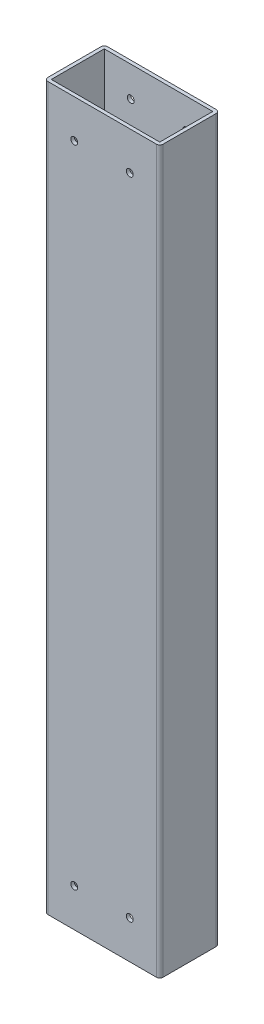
from build123d import *

# Parameters (mm, degrees)
SKETCH1_W           = 49.657
SKETCH1_H           = 24.257
EXTRUDE_THIN1_DEPTH = 165.1
SKETCH2_R           = 1.5875
CUT_EXTRUDE1_DEPTH  = 168.761568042
SKETCH3_R           = 1.5875
CUT_EXTRUDE2_DEPTH  = 168.761568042


with BuildPart() as part:
    # Sketch1 → Extrude-Thin1 (new, symmetric)
    with BuildSketch(Plane(origin=(0, 0, 0), x_dir=(1, 0, 0), z_dir=(0, 1, 0))):
        with BuildLine():
            Line((-26.416, 12.1285), (-26.416, -12.1285))
            ThreePointArc((-26.416, -12.1285), (-25.951032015, -13.251032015), (-24.8285, -13.716))
            Line((-24.8285, -13.716), (24.8285, -13.716))
            ThreePointArc((24.8285, -13.716), (25.951032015, -13.251032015), (26.416, -12.1285))
            Line((26.416, -12.1285), (26.416, 12.1285))
            ThreePointArc((26.416, 12.1285), (25.951032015, 13.251032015), (24.8285, 13.716))
            Line((24.8285, 13.716), (-24.8285, 13.716))
            ThreePointArc((-24.8285, 13.716), (-25.951032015, 13.251032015), (-26.416, 12.1285))
        make_face()
        Rectangle(SKETCH1_W, SKETCH1_H, mode=Mode.SUBTRACT)
    extrude(amount=EXTRUDE_THIN1_DEPTH, both=True)

    # Sketch2 → Cut-Extrude1 (cut, through all)
    with BuildSketch(Plane.XY):
        with Locations((-12.7, 151.257)):
            Circle(SKETCH2_R)
        with Locations((12.7, 151.257)):
            Circle(SKETCH2_R)
        with Locations((12.7, -151.257)):
            Circle(SKETCH2_R)
        with Locations((-12.7, -151.257)):
            Circle(SKETCH2_R)
    extrude(amount=-CUT_EXTRUDE1_DEPTH, mode=Mode.SUBTRACT)

    # Sketch3 → Cut-Extrude2 (cut, through all)
    with BuildSketch(Plane.XY):
        with Locations(Location((12.7, -147.6375, 0), (0, 0, 180))):
            Circle(SKETCH3_R)
        with Locations(Location((-12.7, -147.6375, 0), (0, 0, 180))):
            Circle(SKETCH3_R)
        with Locations(Location((-12.7, 147.6375, 0), (0, 0, 180))):
            Circle(SKETCH3_R)
        with Locations(Location((12.7, 147.6375, 0), (0, 0, 180))):
            Circle(SKETCH3_R)
    extrude(amount=CUT_EXTRUDE2_DEPTH, mode=Mode.SUBTRACT)


solid = part.part
